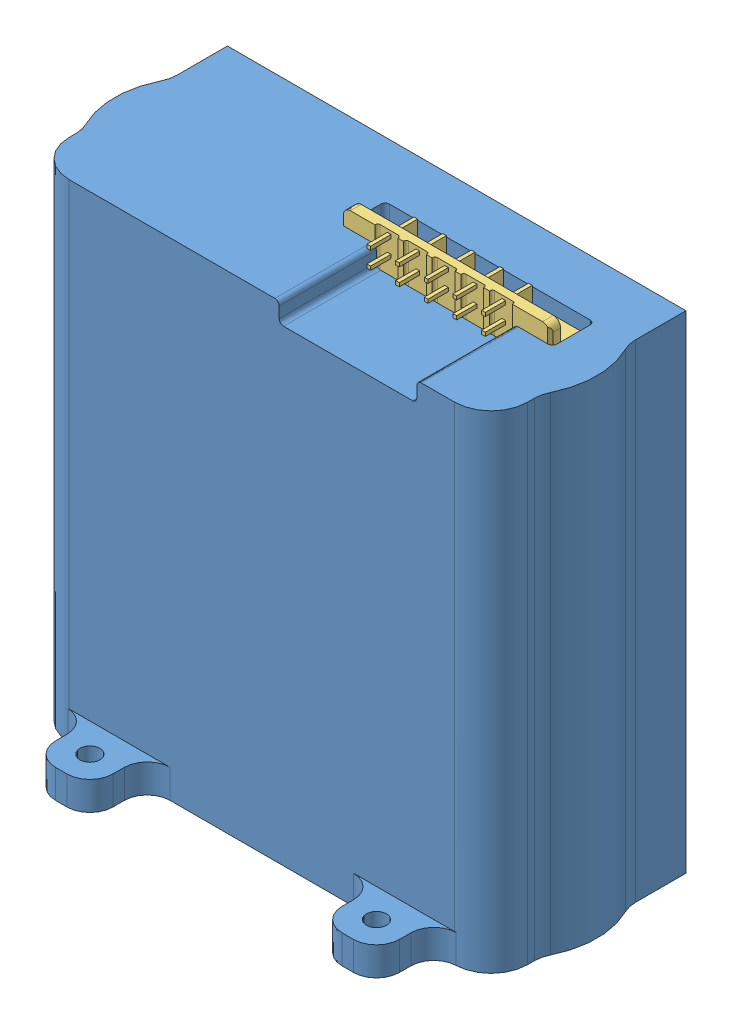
SolidWorks assembly FF-ASD-A-0500.SLDASM, configuration Default (file format 10000). Lengths in mm.
Overall size (84.16 96.5 44).
3 component instances, 3 part files, 6 mates.
Components (placement in the parent):
- FF-ASD-P-0501_BATTERY_HOLDER-1: FF-ASD-P-0501_BATTERY_HOLDER.sldprt [Default] at (-40.5161 1.1449 -57.2301) size (84.16 85 44)
- FF-ASD-P-0502_SNAP_HOOK-1: FF-ASD-P-0502_SNAP_HOOK.sldprt [Default] at (-40.7661 1.1449 -57.4252) size (10 38.6 5.65)
- battery connector-1: battery connector.SLDPRT [Default] at (-25.24 31.6949 15.6649) x (-1 0 0) z (0 -1 0) size (36 9.85 14.85)
Mates (geometry in assembly coordinates):
- Coincident1: coincident anti-aligned: plane of FF-ASD-P-0501_BATTERY_HOLDER-1 through (-45.7661 -11.3551 2.1019) normal (0 0 1); plane of FF-ASD-P-0502_SNAP_HOOK-1 through (3.6376 1.1449 2.1019) normal (0 0 -1)
- Coincident2: coincident anti-aligned: plane of FF-ASD-P-0501_BATTERY_HOLDER-1 through (-45.7661 -11.3551 2.1019) normal (1 0 0); plane of FF-ASD-P-0502_SNAP_HOOK-1 through (-45.7661 -11.3551 1.9068) normal (-1 0 0)
- Coincident3: coincident anti-aligned: plane of FF-ASD-P-0501_BATTERY_HOLDER-1 through (-40.5161 -11.3551 -57.2301) normal (0 -1 0); plane of FF-ASD-P-0502_SNAP_HOOK-1 through (3.6376 -11.3551 -57.4252) normal (0 1 0)
- Coincident4: coincident anti-aligned: plane of FF-ASD-P-0501_BATTERY_HOLDER-1 through (-43.24 43.6449 15.6649) normal (0 0 -1); plane of battery connector-1 through (-7.24 38.9949 15.6649) normal (0 0 1)
- Coincident5: coincident aligned: plane of FF-ASD-P-0501_BATTERY_HOLDER-1 through (-67.9608 38.6449 16.2351) normal (0 -1 0); plane of battery connector-1 through (-7.24 38.6449 9.4711) normal (0 -1 0)
- Coincident6: coincident: line of FF-ASD-P-0501_BATTERY_HOLDER-1 through (-43.24 43.6449 14.9029) axis (0 0 -1); plane of battery connector-1 through (-43.24 31.6949 15.6649) normal (-1 0 0)
